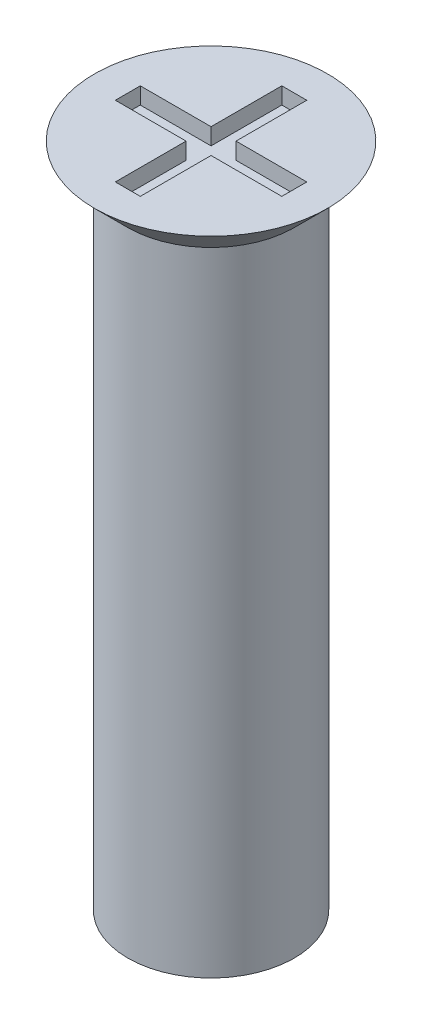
from build123d import *

# Parameters (mm, degrees)
CUT_EXTRUDE1_DEPTH = 0.1


with BuildPart() as part:
    # Sketch1 → Revolve1 (revolve)
    with BuildSketch(Plane.XY, mode=Mode.PRIVATE) as revolve1_sk:
        Polygon((0, 0), (-0.5, 0), (-0.5, 3.8), (-0.7, 4), (0, 4), align=None)
    revolve(revolve1_sk.sketch.rotate(Axis((0, 2.475812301, 0), (0, -1, 0)), 270), axis=Axis((0, 2.475812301, 0), (0, -1, 0)))

    # Sketch2 → Cut-Extrude1 (cut)
    with BuildSketch(Plane(origin=(0, 4, 0), x_dir=(1, 0, 0), z_dir=(0, 1, 0))):
        Polygon((-0.075, -0.075), (-0.075, -0.5), (0.075, -0.5), (0.075, -0.075), (0.5, -0.075), (0.5, 0.075), (0.075, 0.075), (0.075, 0.5), (-0.075, 0.5), (-0.075, 0.075), (-0.5, 0.075), (-0.5, -0.075), align=None)
    extrude(amount=-CUT_EXTRUDE1_DEPTH, mode=Mode.SUBTRACT)


solid = part.part
